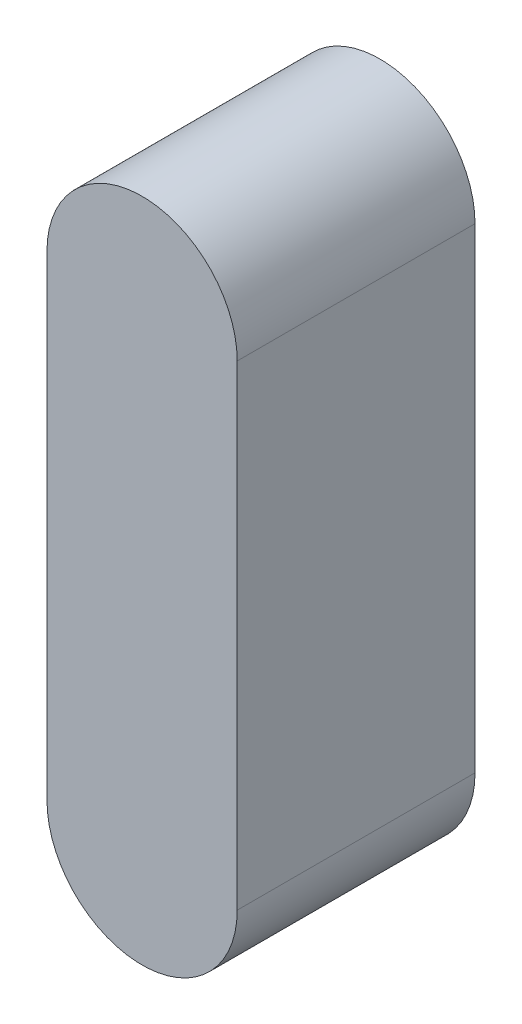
ISO-10303-21;
HEADER;
FILE_DESCRIPTION(('STEP AP214'),'2;1');
FILE_NAME('part.step','',(''),(''),'','','');
FILE_SCHEMA(('AUTOMOTIVE_DESIGN { 1 0 10303 214 1 1 1 1 }'));
ENDSEC;
DATA;
#1=APPLICATION_CONTEXT('core data for automotive mechanical design processes');
#2=APPLICATION_PROTOCOL_DEFINITION('international standard','automotive_design',2000,#1);
#3=PRODUCT_CONTEXT('',#1,'mechanical');
#4=PRODUCT('Part','Part','',(#3));
#5=PRODUCT_RELATED_PRODUCT_CATEGORY('part','',(#4));
#6=PRODUCT_DEFINITION_FORMATION('','',#4);
#7=PRODUCT_DEFINITION_CONTEXT('part definition',#1,'design');
#8=PRODUCT_DEFINITION('design','',#6,#7);
#9=PRODUCT_DEFINITION_SHAPE('','',#8);
#10=(LENGTH_UNIT() NAMED_UNIT(*) SI_UNIT(.MILLI.,.METRE.));
#11=(NAMED_UNIT(*) PLANE_ANGLE_UNIT() SI_UNIT($,.RADIAN.));
#12=(NAMED_UNIT(*) SI_UNIT($,.STERADIAN.) SOLID_ANGLE_UNIT());
#13=UNCERTAINTY_MEASURE_WITH_UNIT(LENGTH_MEASURE(1.E-05),#10,'distance_accuracy_value','');
#14=(GEOMETRIC_REPRESENTATION_CONTEXT(3) GLOBAL_UNCERTAINTY_ASSIGNED_CONTEXT((#13)) GLOBAL_UNIT_ASSIGNED_CONTEXT((#10,
#11,#12)) REPRESENTATION_CONTEXT('',''));
#15=CARTESIAN_POINT('',(0.,0.,0.));
#16=DIRECTION('',(0.,0.,1.));
#17=DIRECTION('',(1.,0.,0.));
#18=AXIS2_PLACEMENT_3D('',#15,#16,#17);
#19=CARTESIAN_POINT('',(0.,78.,5.));
#20=DIRECTION('',(0.,0.,-1.));
#21=DIRECTION('',(-1.,0.,0.));
#22=AXIS2_PLACEMENT_3D('',#19,#20,#21);
#23=CYLINDRICAL_SURFACE('',#22,2.);
#24=CARTESIAN_POINT('',(0.,78.,0.));
#25=DIRECTION('',(0.,0.,1.));
#26=DIRECTION('',(1.,0.,0.));
#27=AXIS2_PLACEMENT_3D('',#24,#25,#26);
#28=CIRCLE('',#27,2.);
#29=CARTESIAN_POINT('',(-2.,78.,0.));
#30=VERTEX_POINT('',#29);
#31=CARTESIAN_POINT('',(2.,78.,0.));
#32=VERTEX_POINT('',#31);
#33=EDGE_CURVE('E94',#30,#32,#28,.T.);
#34=ORIENTED_EDGE('',*,*,#33,.T.);
#35=DIRECTION('',(0.,0.,-1.));
#36=VECTOR('',#35,1.);
#37=CARTESIAN_POINT('',(2.,78.,5.));
#38=LINE('',#37,#36);
#39=CARTESIAN_POINT('',(2.,78.,5.));
#40=VERTEX_POINT('',#39);
#41=EDGE_CURVE('E11',#40,#32,#38,.T.);
#42=ORIENTED_EDGE('',*,*,#41,.F.);
#43=CARTESIAN_POINT('',(0.,78.,5.));
#44=DIRECTION('',(0.,0.,1.));
#45=DIRECTION('',(1.,0.,0.));
#46=AXIS2_PLACEMENT_3D('',#43,#44,#45);
#47=CIRCLE('',#46,2.);
#48=CARTESIAN_POINT('',(-2.,78.,5.));
#49=VERTEX_POINT('',#48);
#50=EDGE_CURVE('E82',#49,#40,#47,.T.);
#51=ORIENTED_EDGE('',*,*,#50,.F.);
#52=DIRECTION('',(0.,0.,-1.));
#53=VECTOR('',#52,1.);
#54=CARTESIAN_POINT('',(-2.,78.,5.));
#55=LINE('',#54,#53);
#56=EDGE_CURVE('E90',#49,#30,#55,.T.);
#57=ORIENTED_EDGE('',*,*,#56,.T.);
#58=EDGE_LOOP('',(#34,#42,#51,#57));
#59=FACE_BOUND('',#58,.T.);
#60=ADVANCED_FACE('F31',(#59),#23,.T.);
#61=CARTESIAN_POINT('',(2.,78.,5.));
#62=DIRECTION('',(-1.,0.,0.));
#63=DIRECTION('',(0.,-1.,0.));
#64=AXIS2_PLACEMENT_3D('',#61,#62,#63);
#65=PLANE('',#64);
#66=DIRECTION('',(0.,1.,0.));
#67=VECTOR('',#66,1.);
#68=CARTESIAN_POINT('',(2.,78.,0.));
#69=LINE('',#68,#67);
#70=CARTESIAN_POINT('',(2.,88.,0.));
#71=VERTEX_POINT('',#70);
#72=EDGE_CURVE('E86',#32,#71,#69,.T.);
#73=ORIENTED_EDGE('',*,*,#72,.T.);
#74=DIRECTION('',(0.,0.,-1.));
#75=VECTOR('',#74,1.);
#76=CARTESIAN_POINT('',(2.,88.,5.));
#77=LINE('',#76,#75);
#78=CARTESIAN_POINT('',(2.,88.,5.));
#79=VERTEX_POINT('',#78);
#80=EDGE_CURVE('E39',#79,#71,#77,.T.);
#81=ORIENTED_EDGE('',*,*,#80,.F.);
#82=DIRECTION('',(0.,1.,0.));
#83=VECTOR('',#82,1.);
#84=CARTESIAN_POINT('',(2.,78.,5.));
#85=LINE('',#84,#83);
#86=EDGE_CURVE('E77',#40,#79,#85,.T.);
#87=ORIENTED_EDGE('',*,*,#86,.F.);
#88=ORIENTED_EDGE('',*,*,#41,.T.);
#89=EDGE_LOOP('',(#73,#81,#87,#88));
#90=FACE_BOUND('',#89,.T.);
#91=ADVANCED_FACE('F85',(#90),#65,.F.);
#92=CARTESIAN_POINT('',(0.,88.,5.));
#93=DIRECTION('',(0.,0.,-1.));
#94=DIRECTION('',(-1.,0.,0.));
#95=AXIS2_PLACEMENT_3D('',#92,#93,#94);
#96=CYLINDRICAL_SURFACE('',#95,2.);
#97=CARTESIAN_POINT('',(0.,88.,0.));
#98=DIRECTION('',(0.,0.,1.));
#99=DIRECTION('',(1.,0.,0.));
#100=AXIS2_PLACEMENT_3D('',#97,#98,#99);
#101=CIRCLE('',#100,2.);
#102=CARTESIAN_POINT('',(-2.,88.,0.));
#103=VERTEX_POINT('',#102);
#104=EDGE_CURVE('E64',#71,#103,#101,.T.);
#105=ORIENTED_EDGE('',*,*,#104,.T.);
#106=DIRECTION('',(0.,0.,-1.));
#107=VECTOR('',#106,1.);
#108=CARTESIAN_POINT('',(-2.,88.,5.));
#109=LINE('',#108,#107);
#110=CARTESIAN_POINT('',(-2.,88.,5.));
#111=VERTEX_POINT('',#110);
#112=EDGE_CURVE('E87',#111,#103,#109,.T.);
#113=ORIENTED_EDGE('',*,*,#112,.F.);
#114=CARTESIAN_POINT('',(0.,88.,5.));
#115=DIRECTION('',(0.,0.,1.));
#116=DIRECTION('',(1.,0.,0.));
#117=AXIS2_PLACEMENT_3D('',#114,#115,#116);
#118=CIRCLE('',#117,2.);
#119=EDGE_CURVE('E80',#79,#111,#118,.T.);
#120=ORIENTED_EDGE('',*,*,#119,.F.);
#121=ORIENTED_EDGE('',*,*,#80,.T.);
#122=EDGE_LOOP('',(#105,#113,#120,#121));
#123=FACE_BOUND('',#122,.T.);
#124=ADVANCED_FACE('F88',(#123),#96,.T.);
#125=CARTESIAN_POINT('',(-2.,88.,5.));
#126=DIRECTION('',(1.,0.,0.));
#127=DIRECTION('',(0.,1.,0.));
#128=AXIS2_PLACEMENT_3D('',#125,#126,#127);
#129=PLANE('',#128);
#130=DIRECTION('',(0.,-1.,0.));
#131=VECTOR('',#130,1.);
#132=CARTESIAN_POINT('',(-2.,88.,0.));
#133=LINE('',#132,#131);
#134=EDGE_CURVE('E70',#103,#30,#133,.T.);
#135=ORIENTED_EDGE('',*,*,#134,.T.);
#136=ORIENTED_EDGE('',*,*,#56,.F.);
#137=DIRECTION('',(0.,-1.,0.));
#138=VECTOR('',#137,1.);
#139=CARTESIAN_POINT('',(-2.,88.,5.));
#140=LINE('',#139,#138);
#141=EDGE_CURVE('E47',#111,#49,#140,.T.);
#142=ORIENTED_EDGE('',*,*,#141,.F.);
#143=ORIENTED_EDGE('',*,*,#112,.T.);
#144=EDGE_LOOP('',(#135,#136,#142,#143));
#145=FACE_BOUND('',#144,.T.);
#146=ADVANCED_FACE('F101',(#145),#129,.F.);
#147=CARTESIAN_POINT('',(0.,78.,5.));
#148=DIRECTION('',(0.,0.,1.));
#149=DIRECTION('',(1.,0.,0.));
#150=AXIS2_PLACEMENT_3D('',#147,#148,#149);
#151=PLANE('',#150);
#152=ORIENTED_EDGE('',*,*,#50,.T.);
#153=ORIENTED_EDGE('',*,*,#86,.T.);
#154=ORIENTED_EDGE('',*,*,#119,.T.);
#155=ORIENTED_EDGE('',*,*,#141,.T.);
#156=EDGE_LOOP('',(#152,#153,#154,#155));
#157=FACE_BOUND('',#156,.T.);
#158=ADVANCED_FACE('F78',(#157),#151,.T.);
#159=CARTESIAN_POINT('',(0.,78.,0.));
#160=DIRECTION('',(0.,0.,1.));
#161=DIRECTION('',(1.,0.,0.));
#162=AXIS2_PLACEMENT_3D('',#159,#160,#161);
#163=PLANE('',#162);
#164=ORIENTED_EDGE('',*,*,#33,.F.);
#165=ORIENTED_EDGE('',*,*,#134,.F.);
#166=ORIENTED_EDGE('',*,*,#104,.F.);
#167=ORIENTED_EDGE('',*,*,#72,.F.);
#168=EDGE_LOOP('',(#164,#165,#166,#167));
#169=FACE_BOUND('',#168,.T.);
#170=ADVANCED_FACE('F104',(#169),#163,.F.);
#171=CLOSED_SHELL('',(#60,#91,#124,#146,#158,#170));
#172=MANIFOLD_SOLID_BREP('B2',#171);
#173=ADVANCED_BREP_SHAPE_REPRESENTATION('',(#18,#172),#14);
#174=SHAPE_DEFINITION_REPRESENTATION(#9,#173);
ENDSEC;
END-ISO-10303-21;
